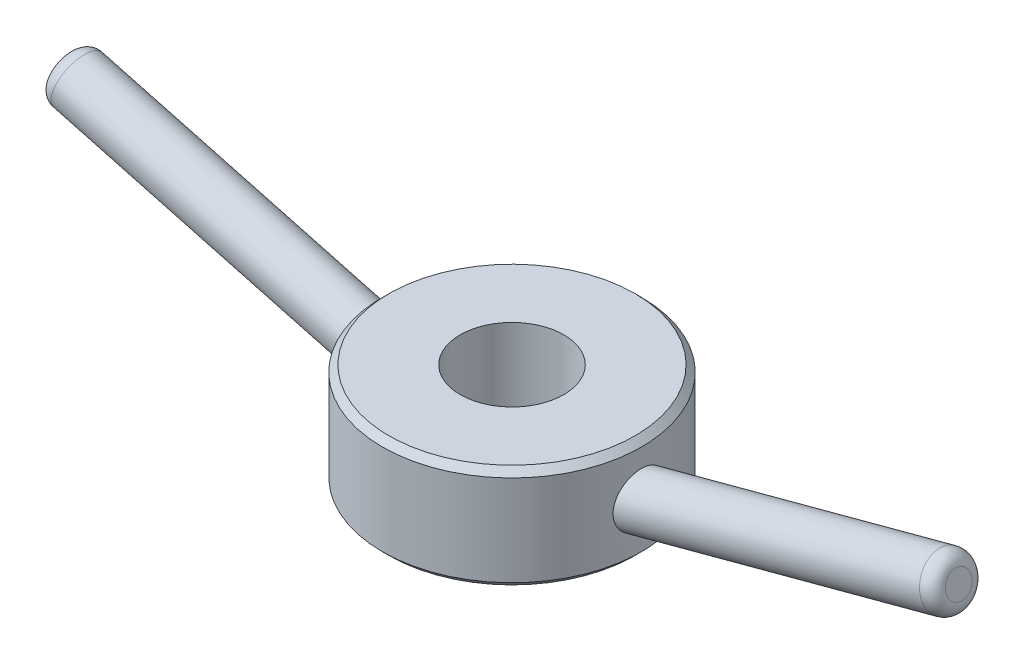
ISO-10303-21;
HEADER;
FILE_DESCRIPTION(('STEP AP214'),'2;1');
FILE_NAME('part.step','',(''),(''),'','','');
FILE_SCHEMA(('AUTOMOTIVE_DESIGN { 1 0 10303 214 1 1 1 1 }'));
ENDSEC;
DATA;
#1=APPLICATION_CONTEXT('core data for automotive mechanical design processes');
#2=APPLICATION_PROTOCOL_DEFINITION('international standard','automotive_design',2000,#1);
#3=PRODUCT_CONTEXT('',#1,'mechanical');
#4=PRODUCT('Part','Part','',(#3));
#5=PRODUCT_RELATED_PRODUCT_CATEGORY('part','',(#4));
#6=PRODUCT_DEFINITION_FORMATION('','',#4);
#7=PRODUCT_DEFINITION_CONTEXT('part definition',#1,'design');
#8=PRODUCT_DEFINITION('design','',#6,#7);
#9=PRODUCT_DEFINITION_SHAPE('','',#8);
#10=(LENGTH_UNIT() NAMED_UNIT(*) SI_UNIT(.MILLI.,.METRE.));
#11=(NAMED_UNIT(*) PLANE_ANGLE_UNIT() SI_UNIT($,.RADIAN.));
#12=(NAMED_UNIT(*) SI_UNIT($,.STERADIAN.) SOLID_ANGLE_UNIT());
#13=UNCERTAINTY_MEASURE_WITH_UNIT(LENGTH_MEASURE(1.E-05),#10,'distance_accuracy_value','');
#14=(GEOMETRIC_REPRESENTATION_CONTEXT(3) GLOBAL_UNCERTAINTY_ASSIGNED_CONTEXT((#13)) GLOBAL_UNIT_ASSIGNED_CONTEXT((#10,
#11,#12)) REPRESENTATION_CONTEXT('',''));
#15=CARTESIAN_POINT('',(0.,0.,0.));
#16=DIRECTION('',(0.,0.,1.));
#17=DIRECTION('',(1.,0.,0.));
#18=AXIS2_PLACEMENT_3D('',#15,#16,#17);
#19=CARTESIAN_POINT('',(0.,25.4,0.));
#20=DIRECTION('',(0.,-1.,0.));
#21=DIRECTION('',(0.,0.,-1.));
#22=AXIS2_PLACEMENT_3D('',#19,#20,#21);
#23=CYLINDRICAL_SURFACE('',#22,63.5);
#24=CARTESIAN_POINT('',(0.,22.2250000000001,0.));
#25=DIRECTION('',(0.,1.,0.));
#26=DIRECTION('',(0.,0.,1.));
#27=AXIS2_PLACEMENT_3D('',#24,#25,#26);
#28=CIRCLE('',#27,63.5);
#29=CARTESIAN_POINT('',(0.,22.2250000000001,-63.5));
#30=VERTEX_POINT('',#29);
#31=EDGE_CURVE('E38',#30,#30,#28,.F.);
#32=ORIENTED_EDGE('',*,*,#31,.T.);
#33=EDGE_LOOP('',(#32));
#34=FACE_BOUND('',#33,.T.);
#35=CARTESIAN_POINT('',(0.,-22.225,0.));
#36=DIRECTION('',(0.,1.,0.));
#37=DIRECTION('',(0.,0.,1.));
#38=AXIS2_PLACEMENT_3D('',#35,#36,#37);
#39=CIRCLE('',#38,63.5);
#40=CARTESIAN_POINT('',(0.,-22.225,63.5));
#41=VERTEX_POINT('',#40);
#42=EDGE_CURVE('E42',#41,#41,#39,.T.);
#43=ORIENTED_EDGE('',*,*,#42,.T.);
#44=EDGE_LOOP('',(#43));
#45=FACE_BOUND('',#44,.T.);
#46=CARTESIAN_POINT('',(-63.5,13.1480074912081,0.));
#47=CARTESIAN_POINT('',(-63.5000030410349,13.1480161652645,0.334108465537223));
#48=CARTESIAN_POINT('',(-63.4973580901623,13.1336423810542,0.668136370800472));
#49=CARTESIAN_POINT('',(-63.4868630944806,13.0763453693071,1.33375525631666));
#50=CARTESIAN_POINT('',(-63.4790120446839,13.0334166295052,1.66534575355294));
#51=CARTESIAN_POINT('',(-63.4583227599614,12.9194835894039,2.32376857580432));
#52=CARTESIAN_POINT('',(-63.4454804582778,12.8484563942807,2.65059679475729));
#53=CARTESIAN_POINT('',(-63.4151811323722,12.6791885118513,3.29688509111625));
#54=CARTESIAN_POINT('',(-63.3977243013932,12.5809489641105,3.61634547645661));
#55=CARTESIAN_POINT('',(-63.3587412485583,12.3586963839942,4.24485303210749));
#56=CARTESIAN_POINT('',(-63.337226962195,12.2347588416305,4.55392768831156));
#57=CARTESIAN_POINT('',(-63.290674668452,11.9622471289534,5.16072766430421));
#58=CARTESIAN_POINT('',(-63.2656366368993,11.81367278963,5.45845290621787));
#59=CARTESIAN_POINT('',(-63.2126890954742,11.4933651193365,6.04081315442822));
#60=CARTESIAN_POINT('',(-63.1847801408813,11.3216362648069,6.32545067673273));
#61=CARTESIAN_POINT('',(-63.1267682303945,10.9564585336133,6.88033396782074));
#62=CARTESIAN_POINT('',(-63.0966644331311,10.7630013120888,7.15057414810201));
#63=CARTESIAN_POINT('',(-63.0335115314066,10.3462274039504,7.68785137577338));
#64=CARTESIAN_POINT('',(-63.0003904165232,10.1219241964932,7.9541146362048));
#65=CARTESIAN_POINT('',(-62.9333599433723,9.65295770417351,8.46814222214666));
#66=CARTESIAN_POINT('',(-62.8994502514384,9.40828568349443,8.71589852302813));
#67=CARTESIAN_POINT('',(-62.8316838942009,8.90043777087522,9.19169501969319));
#68=CARTESIAN_POINT('',(-62.7978272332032,8.63726044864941,9.41973368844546));
#69=CARTESIAN_POINT('',(-62.730979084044,8.09418097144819,9.85508886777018));
#70=CARTESIAN_POINT('',(-62.6979876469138,7.81427783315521,10.0624041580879));
#71=CARTESIAN_POINT('',(-62.6308792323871,7.21473015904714,10.4723328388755));
#72=CARTESIAN_POINT('',(-62.5969099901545,6.89373900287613,10.6730038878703));
#73=CARTESIAN_POINT('',(-62.5318596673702,6.23631269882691,11.0477466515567));
#74=CARTESIAN_POINT('',(-62.5007786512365,5.89987720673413,11.2218177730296));
#75=CARTESIAN_POINT('',(-62.4423700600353,5.21368314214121,11.5423995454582));
#76=CARTESIAN_POINT('',(-62.4150435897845,4.86392068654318,11.688902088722));
#77=CARTESIAN_POINT('',(-62.3649441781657,4.15344047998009,11.9533197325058));
#78=CARTESIAN_POINT('',(-62.3421711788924,3.79272286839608,12.0712351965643));
#79=CARTESIAN_POINT('',(-62.3011223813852,3.04923085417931,12.2813701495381));
#80=CARTESIAN_POINT('',(-62.2830425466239,2.66613298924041,12.3724864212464));
#81=CARTESIAN_POINT('',(-62.2531427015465,1.89351868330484,12.5220624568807));
#82=CARTESIAN_POINT('',(-62.2413202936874,1.50400475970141,12.580534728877));
#83=CARTESIAN_POINT('',(-62.2243773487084,0.721224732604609,12.6640708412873));
#84=CARTESIAN_POINT('',(-62.2192572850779,0.327958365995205,12.6891323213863));
#85=CARTESIAN_POINT('',(-62.2159801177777,-0.459300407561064,12.705191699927));
#86=CARTESIAN_POINT('',(-62.2178227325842,-0.853292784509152,12.6961909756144));
#87=CARTESIAN_POINT('',(-62.2283517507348,-1.62727967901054,12.6444810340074));
#88=CARTESIAN_POINT('',(-62.2368344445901,-2.00734397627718,12.6027751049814));
#89=CARTESIAN_POINT('',(-62.2602174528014,-2.76227153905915,12.4867459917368));
#90=CARTESIAN_POINT('',(-62.2751176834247,-3.13713487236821,12.4124232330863));
#91=CARTESIAN_POINT('',(-62.3109386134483,-3.87855706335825,12.2313300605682));
#92=CARTESIAN_POINT('',(-62.3318578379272,-4.24511793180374,12.1245675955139));
#93=CARTESIAN_POINT('',(-62.3791121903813,-4.9670059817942,11.8790561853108));
#94=CARTESIAN_POINT('',(-62.405447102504,-5.32233361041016,11.7403085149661));
#95=CARTESIAN_POINT('',(-62.4613073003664,-6.00152872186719,11.4392883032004));
#96=CARTESIAN_POINT('',(-62.4906099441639,-6.32608271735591,11.278521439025));
#97=CARTESIAN_POINT('',(-62.5525436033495,-6.95990566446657,10.9298047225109));
#98=CARTESIAN_POINT('',(-62.5851745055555,-7.26917513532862,10.741855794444));
#99=CARTESIAN_POINT('',(-62.6528136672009,-7.87006995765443,10.340039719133));
#100=CARTESIAN_POINT('',(-62.6878216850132,-8.16169709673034,10.1261752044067));
#101=CARTESIAN_POINT('',(-62.7591900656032,-8.72516968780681,9.67400769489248));
#102=CARTESIAN_POINT('',(-62.7955504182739,-8.99701528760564,9.43570488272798));
#103=CARTESIAN_POINT('',(-62.867672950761,-9.51266004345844,8.9423888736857));
#104=CARTESIAN_POINT('',(-62.9034285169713,-9.75697607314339,8.68791463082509));
#105=CARTESIAN_POINT('',(-62.9742003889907,-10.2232014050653,8.15911896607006));
#106=CARTESIAN_POINT('',(-63.0092167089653,-10.445111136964,7.8847979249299));
#107=CARTESIAN_POINT('',(-63.0775286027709,-10.8650443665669,7.3182496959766));
#108=CARTESIAN_POINT('',(-63.110824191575,-11.0630680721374,7.02602266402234));
#109=CARTESIAN_POINT('',(-63.1747660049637,-11.4339417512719,6.4257321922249));
#110=CARTESIAN_POINT('',(-63.205412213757,-11.6067915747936,6.11766865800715));
#111=CARTESIAN_POINT('',(-63.2632051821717,-11.9262176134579,5.48788233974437));
#112=CARTESIAN_POINT('',(-63.2903518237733,-12.0727929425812,5.16615909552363));
#113=CARTESIAN_POINT('',(-63.34039469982,-12.3387439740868,4.51134238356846));
#114=CARTESIAN_POINT('',(-63.3632909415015,-12.4581197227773,4.17824893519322));
#115=CARTESIAN_POINT('',(-63.4042042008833,-12.6689371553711,3.50303841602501));
#116=CARTESIAN_POINT('',(-63.4222211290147,-12.7603783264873,3.16092117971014));
#117=CARTESIAN_POINT('',(-63.4528821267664,-12.9147663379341,2.47007995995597));
#118=CARTESIAN_POINT('',(-63.4655261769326,-12.9777130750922,2.12135595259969));
#119=CARTESIAN_POINT('',(-63.485140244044,-13.0749493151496,1.41817758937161));
#120=CARTESIAN_POINT('',(-63.4920845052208,-13.109108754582,1.06370452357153));
#121=CARTESIAN_POINT('',(-63.5000125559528,-13.1480845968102,0.353081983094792));
#122=CARTESIAN_POINT('',(-63.5009963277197,-13.1529009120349,-0.00306749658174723));
#123=CARTESIAN_POINT('',(-63.4969763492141,-13.1331610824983,-0.714522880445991));
#124=CARTESIAN_POINT('',(-63.4919725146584,-13.1086045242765,-1.06982877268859));
#125=CARTESIAN_POINT('',(-63.476114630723,-13.03026711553,-1.7770724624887));
#126=CARTESIAN_POINT('',(-63.4652605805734,-12.9764862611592,-2.12901025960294));
#127=CARTESIAN_POINT('',(-63.4379820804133,-12.839933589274,-2.82750084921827));
#128=CARTESIAN_POINT('',(-63.4215499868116,-12.7571219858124,-3.17404556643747));
#129=CARTESIAN_POINT('',(-63.3835734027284,-12.5630313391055,-3.85878332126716));
#130=CARTESIAN_POINT('',(-63.3620289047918,-12.4517522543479,-4.19697634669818));
#131=CARTESIAN_POINT('',(-63.3144258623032,-12.201418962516,-4.86259360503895));
#132=CARTESIAN_POINT('',(-63.2883673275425,-12.0623648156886,-5.19001786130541));
#133=CARTESIAN_POINT('',(-63.232463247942,-11.7573587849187,-5.83175288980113));
#134=CARTESIAN_POINT('',(-63.2026177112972,-11.5914069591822,-6.1460636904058));
#135=CARTESIAN_POINT('',(-63.1400289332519,-11.2339697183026,-6.75880512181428));
#136=CARTESIAN_POINT('',(-63.1072906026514,-11.0425273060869,-7.05726133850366));
#137=CARTESIAN_POINT('',(-63.0397939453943,-10.6351478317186,-7.63671906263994));
#138=CARTESIAN_POINT('',(-63.0050356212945,-10.4192108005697,-7.91772059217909));
#139=CARTESIAN_POINT('',(-62.9344823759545,-9.96429744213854,-8.46024652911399));
#140=CARTESIAN_POINT('',(-62.8986875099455,-9.72532234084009,-8.72177197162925));
#141=CARTESIAN_POINT('',(-62.8270735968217,-9.22595797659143,-9.22350579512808));
#142=CARTESIAN_POINT('',(-62.7912545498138,-8.9655688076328,-9.46371426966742));
#143=CARTESIAN_POINT('',(-62.7207747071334,-8.42647330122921,-9.92005504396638));
#144=CARTESIAN_POINT('',(-62.686109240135,-8.14785928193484,-10.1362956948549));
#145=CARTESIAN_POINT('',(-62.618730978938,-7.57318818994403,-10.5445412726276));
#146=CARTESIAN_POINT('',(-62.5860181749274,-7.27713120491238,-10.7365463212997));
#147=CARTESIAN_POINT('',(-62.5234550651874,-6.66970709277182,-11.0950753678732));
#148=CARTESIAN_POINT('',(-62.4936046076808,-6.35834077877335,-11.2616007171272));
#149=CARTESIAN_POINT('',(-62.4375799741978,-5.72252568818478,-11.5681850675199));
#150=CARTESIAN_POINT('',(-62.4114058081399,-5.39807687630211,-11.7082439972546));
#151=CARTESIAN_POINT('',(-62.3634025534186,-4.73803913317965,-11.9612975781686));
#152=CARTESIAN_POINT('',(-62.3415786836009,-4.40243737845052,-12.0742597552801));
#153=CARTESIAN_POINT('',(-62.3028751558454,-3.72286132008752,-12.2724058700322));
#154=CARTESIAN_POINT('',(-62.2859954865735,-3.37888703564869,-12.3575898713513));
#155=CARTESIAN_POINT('',(-62.25758543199,-2.6849520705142,-12.4999331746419));
#156=CARTESIAN_POINT('',(-62.2460554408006,-2.33499095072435,-12.5570904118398));
#157=CARTESIAN_POINT('',(-62.2285922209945,-1.6314939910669,-12.6433478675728));
#158=CARTESIAN_POINT('',(-62.2226591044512,-1.27795807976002,-12.6724475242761));
#159=CARTESIAN_POINT('',(-62.2163985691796,-0.56068372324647,-12.7031495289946));
#160=CARTESIAN_POINT('',(-62.2162167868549,-0.196913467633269,-12.7040374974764));
#161=CARTESIAN_POINT('',(-62.2217554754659,0.529492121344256,-12.6768816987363));
#162=CARTESIAN_POINT('',(-62.2274760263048,0.892127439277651,-12.6488375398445));
#163=CARTESIAN_POINT('',(-62.2445903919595,1.61393740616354,-12.5643471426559));
#164=CARTESIAN_POINT('',(-62.2559843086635,1.97311199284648,-12.5079003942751));
#165=CARTESIAN_POINT('',(-62.2840820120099,2.68589902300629,-12.3672253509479));
#166=CARTESIAN_POINT('',(-62.3007878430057,3.03950926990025,-12.2829863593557));
#167=CARTESIAN_POINT('',(-62.3399424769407,3.75580426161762,-12.0827348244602));
#168=CARTESIAN_POINT('',(-62.3626296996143,4.1181023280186,-11.9653840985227));
#169=CARTESIAN_POINT('',(-62.4126236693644,4.83189254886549,-11.7018114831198));
#170=CARTESIAN_POINT('',(-62.439932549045,5.18337962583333,-11.5555762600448));
#171=CARTESIAN_POINT('',(-62.4983694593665,5.87310839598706,-11.2352265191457));
#172=CARTESIAN_POINT('',(-62.5294977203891,6.21134928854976,-11.0611103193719));
#173=CARTESIAN_POINT('',(-62.5946884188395,6.87230543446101,-10.6860284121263));
#174=CARTESIAN_POINT('',(-62.6287508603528,7.19502066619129,-10.48506266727));
#175=CARTESIAN_POINT('',(-62.6999971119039,7.83290834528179,-10.0503940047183));
#176=CARTESIAN_POINT('',(-62.7372464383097,8.1474931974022,-9.81583830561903));
#177=CARTESIAN_POINT('',(-62.8127243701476,8.75510477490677,-9.32064073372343));
#178=CARTESIAN_POINT('',(-62.8509526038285,9.04813952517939,-9.06000865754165));
#179=CARTESIAN_POINT('',(-62.9272525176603,9.6103538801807,-8.51392421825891));
#180=CARTESIAN_POINT('',(-62.9653241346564,9.87952461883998,-8.22846270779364));
#181=CARTESIAN_POINT('',(-63.0401017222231,10.3912957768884,-7.63447064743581));
#182=CARTESIAN_POINT('',(-63.0768077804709,10.6338979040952,-7.32594158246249));
#183=CARTESIAN_POINT('',(-63.1464713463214,11.0822907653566,-6.69846301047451));
#184=CARTESIAN_POINT('',(-63.1795133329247,11.2890439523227,-6.38021115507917));
#185=CARTESIAN_POINT('',(-63.242155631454,11.6730024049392,-5.72605235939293));
#186=CARTESIAN_POINT('',(-63.271756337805,11.8502110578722,-5.39014744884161));
#187=CARTESIAN_POINT('',(-63.3264935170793,12.1726684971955,-4.70357010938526));
#188=CARTESIAN_POINT('',(-63.3516366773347,12.3179652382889,-4.35292079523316));
#189=CARTESIAN_POINT('',(-63.3966332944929,12.5749174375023,-3.63932914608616));
#190=CARTESIAN_POINT('',(-63.4164886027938,12.6865846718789,-3.276391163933));
#191=CARTESIAN_POINT('',(-63.4550895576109,12.9019970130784,-2.43446390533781));
#192=CARTESIAN_POINT('',(-63.4718441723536,12.9940569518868,-1.95233833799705));
#193=CARTESIAN_POINT('',(-63.4942965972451,13.1170526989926,-0.980083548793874));
#194=CARTESIAN_POINT('',(-63.4999955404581,13.1479947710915,-0.489955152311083));
#195=CARTESIAN_POINT('',(-63.5,13.1480074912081,0.));
#196=B_SPLINE_CURVE_WITH_KNOTS('',3,(#46,#47,#48,#49,#50,#51,#52,#53,#54,#55,#56,#57,#58,#59,
#60,#61,#62,#63,#64,#65,#66,#67,#68,#69,#70,#71,#72,#73,#74,#75,#76,#77,#78,#79,#80,#81,#82,#83,
#84,#85,#86,#87,#88,#89,#90,#91,#92,#93,#94,#95,#96,#97,#98,#99,#100,#101,#102,#103,#104,#105,
#106,#107,#108,#109,#110,#111,#112,#113,#114,#115,#116,#117,#118,#119,#120,#121,#122,#123,#124,
#125,#126,#127,#128,#129,#130,#131,#132,#133,#134,#135,#136,#137,#138,#139,#140,#141,#142,#143,
#144,#145,#146,#147,#148,#149,#150,#151,#152,#153,#154,#155,#156,#157,#158,#159,#160,#161,#162,
#163,#164,#165,#166,#167,#168,#169,#170,#171,#172,#173,#174,#175,#176,#177,#178,#179,#180,#181,
#182,#183,#184,#185,#186,#187,#188,#189,#190,#191,#192,#193,#194,#195),.UNSPECIFIED.,.T.,.F.,(4,
2,2,2,2,2,2,2,2,2,2,2,2,2,2,2,2,2,2,2,2,2,2,2,2,2,2,2,2,2,2,2,2,2,2,2,2,2,2,2,2,2,2,2,2,2,2,2,2,
2,2,2,2,2,2,2,2,2,2,2,2,2,2,2,2,2,2,2,2,2,2,2,2,2,4),(0.,1.00186844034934,2.0039303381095,
3.0068104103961,4.00964849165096,5.00958136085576,6.00952108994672,7.00926777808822,
8.00939974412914,9.05744886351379,10.1059498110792,11.1545318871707,12.2031756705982,
13.3421241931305,14.4810981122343,15.6204064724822,16.7597003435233,17.9408512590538,
19.121549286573,20.3023307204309,21.4830644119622,22.6289300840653,23.7747808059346,
24.9203509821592,26.0658755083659,27.1546587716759,28.2434050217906,29.332040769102,
30.420668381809,31.4831440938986,32.5455994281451,33.6080455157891,34.6704979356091,
35.7329861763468,36.7954726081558,37.8579785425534,38.9204883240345,39.9877732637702,
41.0550613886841,42.1223645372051,43.189667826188,44.2584395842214,45.3272129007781,
46.3959838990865,47.4647525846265,48.5317405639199,49.5987271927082,50.6656570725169,
51.7325822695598,52.7944684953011,53.8563493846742,54.9181739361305,55.9800013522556,
57.0430950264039,58.1061862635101,59.1693558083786,60.2325466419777,61.3226388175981,
62.4127457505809,63.5028722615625,64.5934188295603,65.7366406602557,66.8803914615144,
68.0242112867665,69.168032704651,70.3490919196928,71.529709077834,72.710763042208,
73.8917410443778,75.0330682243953,76.1742644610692,77.3137338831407,78.4528038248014,
79.9221497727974,81.3913451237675),.UNSPECIFIED.);
#197=CARTESIAN_POINT('',(-63.5,13.1480074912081,0.));
#198=VERTEX_POINT('',#197);
#199=EDGE_CURVE('E58',#198,#198,#196,.T.);
#200=ORIENTED_EDGE('',*,*,#199,.T.);
#201=EDGE_LOOP('',(#200));
#202=FACE_BOUND('',#201,.T.);
#203=CARTESIAN_POINT('',(63.5,-13.1480074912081,0.));
#204=CARTESIAN_POINT('',(63.5000031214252,-13.1480125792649,-0.35584768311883));
#205=CARTESIAN_POINT('',(63.4970035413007,-13.133323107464,-0.711615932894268));
#206=CARTESIAN_POINT('',(63.4850938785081,-13.0746609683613,-1.42073835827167));
#207=CARTESIAN_POINT('',(63.4761827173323,-13.0306829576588,-1.77409208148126));
#208=CARTESIAN_POINT('',(63.4526811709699,-12.9136549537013,-2.47602700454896));
#209=CARTESIAN_POINT('',(63.4380864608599,-12.8405828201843,-2.82460436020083));
#210=CARTESIAN_POINT('',(63.4036220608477,-12.6658168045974,-3.51424248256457));
#211=CARTESIAN_POINT('',(63.3837524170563,-12.5641231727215,-3.85530331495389));
#212=CARTESIAN_POINT('',(63.339293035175,-12.3327679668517,-4.52740217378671));
#213=CARTESIAN_POINT('',(63.3147043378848,-12.2031125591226,-4.85844239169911));
#214=CARTESIAN_POINT('',(63.2614875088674,-11.9166314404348,-5.50821847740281));
#215=CARTESIAN_POINT('',(63.2328593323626,-11.7598054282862,-5.82695420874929));
#216=CARTESIAN_POINT('',(63.1723696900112,-11.4200159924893,-6.44977482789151));
#217=CARTESIAN_POINT('',(63.1405088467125,-11.2370575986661,-6.75386252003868));
#218=CARTESIAN_POINT('',(63.0744443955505,-10.8461701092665,-7.345271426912));
#219=CARTESIAN_POINT('',(63.0402408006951,-10.6382411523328,-7.63259273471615));
#220=CARTESIAN_POINT('',(62.9705406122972,-10.199323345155,-8.18774127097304));
#221=CARTESIAN_POINT('',(62.9350473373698,-9.96839134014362,-8.45561385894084));
#222=CARTESIAN_POINT('',(62.8636913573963,-9.48461235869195,-8.97072662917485));
#223=CARTESIAN_POINT('',(62.8278286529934,-9.23176542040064,-9.21796684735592));
#224=CARTESIAN_POINT('',(62.7567486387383,-8.70591589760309,-9.69007235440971));
#225=CARTESIAN_POINT('',(62.7215313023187,-8.43291414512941,-9.91493856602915));
#226=CARTESIAN_POINT('',(62.6527340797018,-7.86867222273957,-10.3407663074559));
#227=CARTESIAN_POINT('',(62.6191541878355,-7.57743211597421,-10.5417279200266));
#228=CARTESIAN_POINT('',(62.5547101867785,-6.9800723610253,-10.9176215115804));
#229=CARTESIAN_POINT('',(62.5238351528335,-6.67402113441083,-11.0926603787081));
#230=CARTESIAN_POINT('',(62.4654888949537,-6.04810116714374,-11.4166460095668));
#231=CARTESIAN_POINT('',(62.4380176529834,-5.72823249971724,-11.5655929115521));
#232=CARTESIAN_POINT('',(62.3872165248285,-5.07697961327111,-11.83656323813));
#233=CARTESIAN_POINT('',(62.3638865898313,-4.74559553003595,-11.9585869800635));
#234=CARTESIAN_POINT('',(62.3219725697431,-4.07367277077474,-12.1751347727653));
#235=CARTESIAN_POINT('',(62.3033885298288,-3.73313400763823,-12.2696585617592));
#236=CARTESIAN_POINT('',(62.271275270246,-3.04211046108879,-12.4316195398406));
#237=CARTESIAN_POINT('',(62.2577944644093,-2.69156276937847,-12.4987977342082));
#238=CARTESIAN_POINT('',(62.2364398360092,-1.9860360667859,-12.6047005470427));
#239=CARTESIAN_POINT('',(62.2285660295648,-1.63105704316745,-12.643425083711));
#240=CARTESIAN_POINT('',(62.2185668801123,-0.919033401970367,-12.6925396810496));
#241=CARTESIAN_POINT('',(62.2164421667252,-0.561988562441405,-12.702926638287));
#242=CARTESIAN_POINT('',(62.2179250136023,0.151812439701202,-12.6956612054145));
#243=CARTESIAN_POINT('',(62.2215329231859,0.508568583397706,-12.6780071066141));
#244=CARTESIAN_POINT('',(62.2345536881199,1.23279294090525,-12.6139383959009));
#245=CARTESIAN_POINT('',(62.2441779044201,1.60016477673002,-12.5664762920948));
#246=CARTESIAN_POINT('',(62.2690763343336,2.32977631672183,-12.4425124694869));
#247=CARTESIAN_POINT('',(62.2843506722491,2.69201590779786,-12.3660101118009));
#248=CARTESIAN_POINT('',(62.3200732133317,3.40910607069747,-12.184703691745));
#249=CARTESIAN_POINT('',(62.3405218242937,3.76395605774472,-12.0798973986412));
#250=CARTESIAN_POINT('',(62.3860043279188,4.46416968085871,-11.8427628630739));
#251=CARTESIAN_POINT('',(62.4110398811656,4.80952982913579,-11.7104246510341));
#252=CARTESIAN_POINT('',(62.4662990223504,5.50491536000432,-11.4120812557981));
#253=CARTESIAN_POINT('',(62.4967146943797,5.85436134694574,-11.2447593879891));
#254=CARTESIAN_POINT('',(62.5609291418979,6.5381256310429,-10.8818245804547));
#255=CARTESIAN_POINT('',(62.59472951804,6.87243666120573,-10.6861982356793));
#256=CARTESIAN_POINT('',(62.6647249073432,7.52347291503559,-10.2677769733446));
#257=CARTESIAN_POINT('',(62.7009205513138,7.8401934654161,-10.0449748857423));
#258=CARTESIAN_POINT('',(62.774626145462,8.45341320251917,-9.57356688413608));
#259=CARTESIAN_POINT('',(62.8121354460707,8.74992217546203,-9.32497360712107));
#260=CARTESIAN_POINT('',(62.8877433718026,9.32321519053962,-8.80071179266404));
#261=CARTESIAN_POINT('',(62.925844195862,9.59978221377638,-8.52480595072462));
#262=CARTESIAN_POINT('',(63.0010897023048,10.1273581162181,-7.9496384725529));
#263=CARTESIAN_POINT('',(63.0382348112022,10.3783785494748,-7.6503875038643));
#264=CARTESIAN_POINT('',(63.1104030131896,10.8524256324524,-7.03025196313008));
#265=CARTESIAN_POINT('',(63.145426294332,11.0754547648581,-6.70936931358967));
#266=CARTESIAN_POINT('',(63.2121906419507,11.4909910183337,-6.0480850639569));
#267=CARTESIAN_POINT('',(63.2439319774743,11.6835006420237,-5.70768506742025));
#268=CARTESIAN_POINT('',(63.3011428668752,12.0243140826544,-5.03217212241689));
#269=CARTESIAN_POINT('',(63.326883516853,12.1746560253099,-4.69811014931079));
#270=CARTESIAN_POINT('',(63.3737036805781,12.4446192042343,-4.01746234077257));
#271=CARTESIAN_POINT('',(63.3947833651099,12.5642415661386,-3.67087696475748));
#272=CARTESIAN_POINT('',(63.4315698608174,12.7711083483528,-2.96810849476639));
#273=CARTESIAN_POINT('',(63.4472798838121,12.8583721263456,-2.61193127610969));
#274=CARTESIAN_POINT('',(63.4728029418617,12.9993734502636,-1.89279685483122));
#275=CARTESIAN_POINT('',(63.4826164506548,13.0531136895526,-1.52984019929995));
#276=CARTESIAN_POINT('',(63.495405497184,13.1230085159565,-0.832995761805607));
#277=CARTESIAN_POINT('',(63.4989136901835,13.1420925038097,-0.499408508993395));
#278=CARTESIAN_POINT('',(63.5006543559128,13.1515706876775,0.168174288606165));
#279=CARTESIAN_POINT('',(63.4988871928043,13.1419668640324,0.502169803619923));
#280=CARTESIAN_POINT('',(63.4901304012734,13.0941971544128,1.16798303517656));
#281=CARTESIAN_POINT('',(63.4831415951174,13.0560357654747,1.49980108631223));
#282=CARTESIAN_POINT('',(63.4641480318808,12.9516333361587,2.15884024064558));
#283=CARTESIAN_POINT('',(63.4521432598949,12.8853922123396,2.48606133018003));
#284=CARTESIAN_POINT('',(63.4238950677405,12.7280296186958,3.12383981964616));
#285=CARTESIAN_POINT('',(63.4077894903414,12.6377134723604,3.43460270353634));
#286=CARTESIAN_POINT('',(63.3716117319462,12.4323943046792,4.0476045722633));
#287=CARTESIAN_POINT('',(63.3515396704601,12.3173920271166,4.34984381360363));
#288=CARTESIAN_POINT('',(63.3079427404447,12.0638696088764,4.94399906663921));
#289=CARTESIAN_POINT('',(63.2844180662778,11.9253507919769,5.23591565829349));
#290=CARTESIAN_POINT('',(63.2344849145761,11.6260345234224,5.80795995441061));
#291=CARTESIAN_POINT('',(63.2080753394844,11.4652285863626,6.08808311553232));
#292=CARTESIAN_POINT('',(63.1515834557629,11.1139238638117,6.64913912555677));
#293=CARTESIAN_POINT('',(63.1213819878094,10.9223215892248,6.92936899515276));
#294=CARTESIAN_POINT('',(63.0592352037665,10.5176311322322,7.47381972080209));
#295=CARTESIAN_POINT('',(63.0272891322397,10.3045336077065,7.73803353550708));
#296=CARTESIAN_POINT('',(62.9624364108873,9.85858117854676,8.24911935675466));
#297=CARTESIAN_POINT('',(62.929529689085,9.62572479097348,8.4959900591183));
#298=CARTESIAN_POINT('',(62.8635286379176,9.14192819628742,8.97130729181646));
#299=CARTESIAN_POINT('',(62.8304342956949,8.89098673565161,9.19975254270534));
#300=CARTESIAN_POINT('',(62.7619290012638,8.34985900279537,9.65651066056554));
#301=CARTESIAN_POINT('',(62.7265703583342,8.05816232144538,9.88304408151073));
#302=CARTESIAN_POINT('',(62.6574722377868,7.45741095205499,10.3120509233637));
#303=CARTESIAN_POINT('',(62.6237327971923,7.14835586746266,10.5145237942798));
#304=CARTESIAN_POINT('',(62.5587576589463,6.51486286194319,10.8944482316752));
#305=CARTESIAN_POINT('',(62.527522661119,6.19042068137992,11.0718928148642));
#306=CARTESIAN_POINT('',(62.4683976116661,5.52826769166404,11.4007553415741));
#307=CARTESIAN_POINT('',(62.4405079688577,5.19055526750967,11.5521701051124));
#308=CARTESIAN_POINT('',(62.3873486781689,4.48418863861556,11.8359951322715));
#309=CARTESIAN_POINT('',(62.3623225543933,4.11487274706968,11.9668078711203));
#310=CARTESIAN_POINT('',(62.3176672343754,3.36645180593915,12.1972179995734));
#311=CARTESIAN_POINT('',(62.2980361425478,2.98735024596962,12.2968263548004));
#312=CARTESIAN_POINT('',(62.264811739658,2.22179195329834,12.4639678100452));
#313=CARTESIAN_POINT('',(62.2512196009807,1.8353338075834,12.5314946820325));
#314=CARTESIAN_POINT('',(62.2305775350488,1.05791341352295,12.6336038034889));
#315=CARTESIAN_POINT('',(62.2235274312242,0.666951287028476,12.6681869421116));
#316=CARTESIAN_POINT('',(62.2163216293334,-0.112314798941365,12.7035289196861));
#317=CARTESIAN_POINT('',(62.2160918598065,-0.500601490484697,12.7046511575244));
#318=CARTESIAN_POINT('',(62.2224416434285,-1.27579450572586,12.6735162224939));
#319=CARTESIAN_POINT('',(62.2290212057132,-1.66270082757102,12.6412590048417));
#320=CARTESIAN_POINT('',(62.2488711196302,-2.43196561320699,12.5431473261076));
#321=CARTESIAN_POINT('',(62.2621397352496,-2.81432523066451,12.4773015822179));
#322=CARTESIAN_POINT('',(62.2950220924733,-3.57145164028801,12.3120799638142));
#323=CARTESIAN_POINT('',(62.3146355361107,-3.94621878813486,12.2127056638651));
#324=CARTESIAN_POINT('',(62.358511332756,-4.66660537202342,11.9866019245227));
#325=CARTESIAN_POINT('',(62.3824937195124,-5.01274716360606,11.8614801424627));
#326=CARTESIAN_POINT('',(62.4349932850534,-5.69264458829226,11.5819611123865));
#327=CARTESIAN_POINT('',(62.4635103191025,-6.02640061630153,11.4275647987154));
#328=CARTESIAN_POINT('',(62.5242438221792,-6.67886816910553,11.0904571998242));
#329=CARTESIAN_POINT('',(62.5564596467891,-6.99758230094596,10.9077508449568));
#330=CARTESIAN_POINT('',(62.6236351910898,-7.61754583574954,10.5152241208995));
#331=CARTESIAN_POINT('',(62.6585948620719,-7.91879554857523,10.3054042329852));
#332=CARTESIAN_POINT('',(62.7289710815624,-8.49148717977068,9.86780494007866));
#333=CARTESIAN_POINT('',(62.7643306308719,-8.76359772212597,9.64089064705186));
#334=CARTESIAN_POINT('',(62.8356223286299,-9.28744625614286,9.16474192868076));
#335=CARTESIAN_POINT('',(62.8715544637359,-9.5391847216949,8.9155080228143));
#336=CARTESIAN_POINT('',(62.9429781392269,-10.0205829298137,8.39643542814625));
#337=CARTESIAN_POINT('',(62.978469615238,-10.2502394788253,8.12659376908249));
#338=CARTESIAN_POINT('',(63.0480020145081,-10.6858764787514,7.56826043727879));
#339=CARTESIAN_POINT('',(63.0820429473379,-10.8918570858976,7.27976888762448));
#340=CARTESIAN_POINT('',(63.1475448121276,-11.277777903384,6.68773542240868));
#341=CARTESIAN_POINT('',(63.1790181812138,-11.4578473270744,6.38427909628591));
#342=CARTESIAN_POINT('',(63.2387066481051,-11.7920531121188,5.76310123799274));
#343=CARTESIAN_POINT('',(63.2669217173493,-11.9461892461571,5.44537958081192));
#344=CARTESIAN_POINT('',(63.3192946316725,-12.2274547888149,4.79814671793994));
#345=CARTESIAN_POINT('',(63.3434554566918,-12.3546040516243,4.46864438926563));
#346=CARTESIAN_POINT('',(63.387079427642,-12.5812273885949,3.80006336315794));
#347=CARTESIAN_POINT('',(63.4065433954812,-12.6807063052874,3.46098635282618));
#348=CARTESIAN_POINT('',(63.4484063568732,-12.8927845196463,2.60935082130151));
#349=CARTESIAN_POINT('',(63.4676609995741,-12.988402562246,2.09231015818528));
#350=CARTESIAN_POINT('',(63.493455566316,-13.1160105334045,1.05012207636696));
#351=CARTESIAN_POINT('',(63.4999953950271,-13.1479999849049,0.524974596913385));
#352=CARTESIAN_POINT('',(63.5,-13.1480074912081,0.));
#353=B_SPLINE_CURVE_WITH_KNOTS('',3,(#203,#204,#205,#206,#207,#208,#209,#210,#211,#212,#213,
#214,#215,#216,#217,#218,#219,#220,#221,#222,#223,#224,#225,#226,#227,#228,#229,#230,#231,#232,
#233,#234,#235,#236,#237,#238,#239,#240,#241,#242,#243,#244,#245,#246,#247,#248,#249,#250,#251,
#252,#253,#254,#255,#256,#257,#258,#259,#260,#261,#262,#263,#264,#265,#266,#267,#268,#269,#270,
#271,#272,#273,#274,#275,#276,#277,#278,#279,#280,#281,#282,#283,#284,#285,#286,#287,#288,#289,
#290,#291,#292,#293,#294,#295,#296,#297,#298,#299,#300,#301,#302,#303,#304,#305,#306,#307,#308,
#309,#310,#311,#312,#313,#314,#315,#316,#317,#318,#319,#320,#321,#322,#323,#324,#325,#326,#327,
#328,#329,#330,#331,#332,#333,#334,#335,#336,#337,#338,#339,#340,#341,#342,#343,#344,#345,#346,
#347,#348,#349,#350,#351,#352),.UNSPECIFIED.,.T.,.F.,(4,2,2,2,2,2,2,2,2,2,2,2,2,2,2,2,2,2,2,2,2,
2,2,2,2,2,2,2,2,2,2,2,2,2,2,2,2,2,2,2,2,2,2,2,2,2,2,2,2,2,2,2,2,2,2,2,2,2,2,2,2,2,2,2,2,2,2,2,2,
2,2,2,2,2,4),(0.,1.06709042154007,2.13437557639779,3.2024744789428,4.27056404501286,
5.33841831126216,6.40628441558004,7.47394525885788,8.54160017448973,9.60667923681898,
10.6717564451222,11.7367897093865,12.8018192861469,13.8623272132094,14.9228295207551,
15.9833193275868,17.0438192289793,18.1141418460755,19.1844675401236,20.2549104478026,
21.3254185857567,22.4358288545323,23.5462635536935,24.6567857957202,25.7677108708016,
26.9322564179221,28.0973553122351,29.2627622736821,30.4276008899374,31.6036372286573,
32.7791392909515,33.954537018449,35.1298383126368,36.2300719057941,37.3302651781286,
38.4297992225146,39.5292449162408,40.5304490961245,41.531584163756,42.532561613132,
43.5335420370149,44.5045174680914,45.4754636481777,46.4463551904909,47.4176174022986,
48.4389592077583,49.460746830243,50.4826112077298,51.5045464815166,52.6163795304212,
53.7282379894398,54.8404060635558,55.9527099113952,57.1290979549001,58.3050721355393,
59.4812745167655,60.6574451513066,61.8208373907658,62.9842311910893,64.1473232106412,
65.3103606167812,66.4155125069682,67.520629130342,68.625553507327,69.730458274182,
70.7973880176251,71.8642929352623,72.9313519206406,73.998403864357,75.0599351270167,
76.1214756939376,77.1822325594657,78.2428036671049,79.8170479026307,81.3913039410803),.UNSPECIFIED.);
#354=CARTESIAN_POINT('',(63.5,-13.1480074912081,0.));
#355=VERTEX_POINT('',#354);
#356=EDGE_CURVE('E90',#355,#355,#353,.T.);
#357=ORIENTED_EDGE('',*,*,#356,.F.);
#358=EDGE_LOOP('',(#357));
#359=FACE_BOUND('',#358,.T.);
#360=ADVANCED_FACE('F31',(#34,#45,#202,#359),#23,.T.);
#361=CARTESIAN_POINT('',(0.,25.4,0.));
#362=DIRECTION('',(0.,1.,0.));
#363=DIRECTION('',(0.,0.,1.));
#364=AXIS2_PLACEMENT_3D('',#361,#362,#363);
#365=PLANE('',#364);
#366=CARTESIAN_POINT('',(0.,25.4,0.));
#367=DIRECTION('',(0.,1.,0.));
#368=DIRECTION('',(0.,0.,1.));
#369=AXIS2_PLACEMENT_3D('',#366,#367,#368);
#370=CIRCLE('',#369,60.3250000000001);
#371=CARTESIAN_POINT('',(0.,25.4,-60.3250000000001));
#372=VERTEX_POINT('',#371);
#373=EDGE_CURVE('E46',#372,#372,#370,.T.);
#374=ORIENTED_EDGE('',*,*,#373,.T.);
#375=EDGE_LOOP('',(#374));
#376=FACE_BOUND('',#375,.T.);
#377=CARTESIAN_POINT('',(0.,25.4,0.));
#378=DIRECTION('',(0.,1.,0.));
#379=DIRECTION('',(0.,0.,1.));
#380=AXIS2_PLACEMENT_3D('',#377,#378,#379);
#381=CIRCLE('',#380,25.4);
#382=CARTESIAN_POINT('',(0.,25.4,25.4));
#383=VERTEX_POINT('',#382);
#384=EDGE_CURVE('E96',#383,#383,#381,.T.);
#385=ORIENTED_EDGE('',*,*,#384,.F.);
#386=EDGE_LOOP('',(#385));
#387=FACE_BOUND('',#386,.T.);
#388=ADVANCED_FACE('F110',(#376,#387),#365,.T.);
#389=CARTESIAN_POINT('',(0.,-25.4,0.));
#390=DIRECTION('',(0.,1.,0.));
#391=DIRECTION('',(0.,0.,1.));
#392=AXIS2_PLACEMENT_3D('',#389,#390,#391);
#393=PLANE('',#392);
#394=CARTESIAN_POINT('',(0.,-25.4,0.));
#395=DIRECTION('',(0.,1.,0.));
#396=DIRECTION('',(0.,0.,1.));
#397=AXIS2_PLACEMENT_3D('',#394,#395,#396);
#398=CIRCLE('',#397,60.325);
#399=CARTESIAN_POINT('',(0.,-25.4,60.325));
#400=VERTEX_POINT('',#399);
#401=EDGE_CURVE('E10',#400,#400,#398,.F.);
#402=ORIENTED_EDGE('',*,*,#401,.T.);
#403=EDGE_LOOP('',(#402));
#404=FACE_BOUND('',#403,.T.);
#405=CARTESIAN_POINT('',(0.,-25.4,0.));
#406=DIRECTION('',(0.,1.,0.));
#407=DIRECTION('',(0.,0.,1.));
#408=AXIS2_PLACEMENT_3D('',#405,#406,#407);
#409=CIRCLE('',#408,25.4);
#410=CARTESIAN_POINT('',(0.,-25.4,25.4));
#411=VERTEX_POINT('',#410);
#412=EDGE_CURVE('E65',#411,#411,#409,.T.);
#413=ORIENTED_EDGE('',*,*,#412,.T.);
#414=EDGE_LOOP('',(#413));
#415=FACE_BOUND('',#414,.T.);
#416=ADVANCED_FACE('F114',(#404,#415),#393,.F.);
#417=CARTESIAN_POINT('',(0.,25.4,0.));
#418=DIRECTION('',(0.,-1.,0.));
#419=DIRECTION('',(0.,0.,-1.));
#420=AXIS2_PLACEMENT_3D('',#417,#418,#419);
#421=CYLINDRICAL_SURFACE('',#420,25.4);
#422=ORIENTED_EDGE('',*,*,#384,.T.);
#423=EDGE_LOOP('',(#422));
#424=FACE_BOUND('',#423,.T.);
#425=ORIENTED_EDGE('',*,*,#412,.F.);
#426=EDGE_LOOP('',(#425));
#427=FACE_BOUND('',#426,.T.);
#428=ADVANCED_FACE('F86',(#424,#427),#421,.F.);
#429=CARTESIAN_POINT('',(218.930708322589,41.6475327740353,0.));
#430=DIRECTION('',(-0.965925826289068,-0.258819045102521,0.));
#431=DIRECTION('',(0.258819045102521,-0.965925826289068,0.));
#432=AXIS2_PLACEMENT_3D('',#429,#430,#431);
#433=CYLINDRICAL_SURFACE('',#432,12.7);
#434=CARTESIAN_POINT('',(212.797079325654,40.0040318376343,0.));
#435=DIRECTION('',(0.965925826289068,0.258819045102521,0.));
#436=DIRECTION('',(-0.258819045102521,0.965925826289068,0.));
#437=AXIS2_PLACEMENT_3D('',#434,#435,#436);
#438=CIRCLE('',#437,12.7);
#439=CARTESIAN_POINT('',(209.510077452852,52.2712898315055,0.));
#440=VERTEX_POINT('',#439);
#441=EDGE_CURVE('E57',#440,#440,#438,.F.);
#442=ORIENTED_EDGE('',*,*,#441,.T.);
#443=EDGE_LOOP('',(#442));
#444=FACE_BOUND('',#443,.T.);
#445=ORIENTED_EDGE('',*,*,#356,.T.);
#446=EDGE_LOOP('',(#445));
#447=FACE_BOUND('',#446,.T.);
#448=ADVANCED_FACE('F81',(#444,#447),#433,.T.);
#449=CARTESIAN_POINT('',(218.930708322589,41.6475327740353,0.));
#450=DIRECTION('',(0.965925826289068,0.258819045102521,0.));
#451=DIRECTION('',(-0.258819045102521,0.965925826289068,0.));
#452=AXIS2_PLACEMENT_3D('',#449,#450,#451);
#453=PLANE('',#452);
#454=CARTESIAN_POINT('',(218.930708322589,41.6475327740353,0.));
#455=DIRECTION('',(0.965925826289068,0.258819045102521,0.));
#456=DIRECTION('',(-0.258819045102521,0.965925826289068,0.));
#457=AXIS2_PLACEMENT_3D('',#454,#455,#456);
#458=CIRCLE('',#457,6.35);
#459=CARTESIAN_POINT('',(217.287207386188,47.7811617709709,0.));
#460=VERTEX_POINT('',#459);
#461=EDGE_CURVE('E95',#460,#460,#458,.T.);
#462=ORIENTED_EDGE('',*,*,#461,.T.);
#463=EDGE_LOOP('',(#462));
#464=FACE_BOUND('',#463,.T.);
#465=ADVANCED_FACE('F78',(#464),#453,.T.);
#466=CARTESIAN_POINT('',(212.797079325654,40.0040318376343,0.));
#467=DIRECTION('',(0.965925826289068,0.258819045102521,0.));
#468=DIRECTION('',(-0.258819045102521,0.965925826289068,0.));
#469=AXIS2_PLACEMENT_3D('',#466,#467,#468);
#470=DEGENERATE_TOROIDAL_SURFACE('',#469,6.35,6.35,.T.);
#471=ORIENTED_EDGE('',*,*,#441,.F.);
#472=EDGE_LOOP('',(#471));
#473=FACE_BOUND('',#472,.T.);
#474=ORIENTED_EDGE('',*,*,#461,.F.);
#475=EDGE_LOOP('',(#474));
#476=FACE_BOUND('',#475,.T.);
#477=ADVANCED_FACE('F76',(#473,#476),#470,.T.);
#478=CARTESIAN_POINT('',(-218.930708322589,41.6475327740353,0.));
#479=DIRECTION('',(0.965925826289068,-0.258819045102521,0.));
#480=DIRECTION('',(0.258819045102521,0.965925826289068,0.));
#481=AXIS2_PLACEMENT_3D('',#478,#479,#480);
#482=CYLINDRICAL_SURFACE('',#481,12.7);
#483=CARTESIAN_POINT('',(-212.797079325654,40.0040318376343,0.));
#484=DIRECTION('',(-0.965925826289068,0.258819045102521,0.));
#485=DIRECTION('',(-0.258819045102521,-0.965925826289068,0.));
#486=AXIS2_PLACEMENT_3D('',#483,#484,#485);
#487=CIRCLE('',#486,12.7);
#488=CARTESIAN_POINT('',(-216.084081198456,27.7367738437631,0.));
#489=VERTEX_POINT('',#488);
#490=EDGE_CURVE('E54',#489,#489,#487,.F.);
#491=ORIENTED_EDGE('',*,*,#490,.T.);
#492=EDGE_LOOP('',(#491));
#493=FACE_BOUND('',#492,.T.);
#494=ORIENTED_EDGE('',*,*,#199,.F.);
#495=EDGE_LOOP('',(#494));
#496=FACE_BOUND('',#495,.T.);
#497=ADVANCED_FACE('F70',(#493,#496),#482,.T.);
#498=CARTESIAN_POINT('',(-218.930708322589,41.6475327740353,0.));
#499=DIRECTION('',(-0.965925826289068,0.258819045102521,0.));
#500=DIRECTION('',(0.258819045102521,0.965925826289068,0.));
#501=AXIS2_PLACEMENT_3D('',#498,#499,#500);
#502=PLANE('',#501);
#503=CARTESIAN_POINT('',(-218.930708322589,41.6475327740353,0.));
#504=DIRECTION('',(-0.965925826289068,0.258819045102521,0.));
#505=DIRECTION('',(-0.258819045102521,-0.965925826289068,0.));
#506=AXIS2_PLACEMENT_3D('',#503,#504,#505);
#507=CIRCLE('',#506,6.35);
#508=CARTESIAN_POINT('',(-220.57420925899,35.5139037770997,0.));
#509=VERTEX_POINT('',#508);
#510=EDGE_CURVE('E51',#509,#509,#507,.T.);
#511=ORIENTED_EDGE('',*,*,#510,.T.);
#512=EDGE_LOOP('',(#511));
#513=FACE_BOUND('',#512,.T.);
#514=ADVANCED_FACE('F75',(#513),#502,.T.);
#515=CARTESIAN_POINT('',(-212.797079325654,40.0040318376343,0.));
#516=DIRECTION('',(-0.965925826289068,0.258819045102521,0.));
#517=DIRECTION('',(-0.258819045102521,-0.965925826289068,0.));
#518=AXIS2_PLACEMENT_3D('',#515,#516,#517);
#519=DEGENERATE_TOROIDAL_SURFACE('',#518,6.35,6.35,.T.);
#520=ORIENTED_EDGE('',*,*,#510,.F.);
#521=EDGE_LOOP('',(#520));
#522=FACE_BOUND('',#521,.T.);
#523=ORIENTED_EDGE('',*,*,#490,.F.);
#524=EDGE_LOOP('',(#523));
#525=FACE_BOUND('',#524,.T.);
#526=ADVANCED_FACE('F130',(#522,#525),#519,.T.);
#527=CARTESIAN_POINT('',(0.,25.4,0.));
#528=DIRECTION('',(0.,-1.,0.));
#529=DIRECTION('',(0.,0.,-1.));
#530=AXIS2_PLACEMENT_3D('',#527,#528,#529);
#531=CONICAL_SURFACE('',#530,60.3250000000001,0.785398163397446);
#532=CARTESIAN_POINT('',(0.,22.2250000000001,-63.5));
#533=CARTESIAN_POINT('',(0.,22.2580729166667,-63.4669270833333));
#534=CARTESIAN_POINT('',(0.,22.2911458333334,-63.4338541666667));
#535=CARTESIAN_POINT('',(0.,22.3572916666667,-63.3677083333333));
#536=CARTESIAN_POINT('',(0.,22.3903645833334,-63.3346354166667));
#537=CARTESIAN_POINT('',(0.,22.4565104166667,-63.2684895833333));
#538=CARTESIAN_POINT('',(0.,22.4895833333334,-63.2354166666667));
#539=CARTESIAN_POINT('',(0.,22.5557291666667,-63.1692708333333));
#540=CARTESIAN_POINT('',(0.,22.5888020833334,-63.1361979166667));
#541=CARTESIAN_POINT('',(0.,22.6549479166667,-63.0700520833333));
#542=CARTESIAN_POINT('',(0.,22.6880208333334,-63.0369791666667));
#543=CARTESIAN_POINT('',(0.,22.7541666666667,-62.9708333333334));
#544=CARTESIAN_POINT('',(0.,22.7872395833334,-62.9377604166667));
#545=CARTESIAN_POINT('',(0.,22.8533854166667,-62.8716145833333));
#546=CARTESIAN_POINT('',(0.,22.8864583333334,-62.8385416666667));
#547=CARTESIAN_POINT('',(0.,22.9526041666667,-62.7723958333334));
#548=CARTESIAN_POINT('',(0.,22.9856770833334,-62.7393229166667));
#549=CARTESIAN_POINT('',(0.,23.0518229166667,-62.6731770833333));
#550=CARTESIAN_POINT('',(0.,23.0848958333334,-62.6401041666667));
#551=CARTESIAN_POINT('',(0.,23.1510416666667,-62.5739583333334));
#552=CARTESIAN_POINT('',(0.,23.1841145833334,-62.5408854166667));
#553=CARTESIAN_POINT('',(0.,23.2502604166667,-62.4747395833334));
#554=CARTESIAN_POINT('',(0.,23.2833333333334,-62.4416666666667));
#555=CARTESIAN_POINT('',(0.,23.3494791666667,-62.3755208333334));
#556=CARTESIAN_POINT('',(0.,23.3825520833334,-62.3424479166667));
#557=CARTESIAN_POINT('',(0.,23.4486979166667,-62.2763020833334));
#558=CARTESIAN_POINT('',(0.,23.4817708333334,-62.2432291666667));
#559=CARTESIAN_POINT('',(0.,23.5479166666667,-62.1770833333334));
#560=CARTESIAN_POINT('',(0.,23.5809895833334,-62.1440104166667));
#561=CARTESIAN_POINT('',(0.,23.6471354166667,-62.0778645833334));
#562=CARTESIAN_POINT('',(0.,23.6802083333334,-62.0447916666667));
#563=CARTESIAN_POINT('',(0.,23.7463541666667,-61.9786458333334));
#564=CARTESIAN_POINT('',(0.,23.7794270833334,-61.9455729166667));
#565=CARTESIAN_POINT('',(0.,23.8455729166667,-61.8794270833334));
#566=CARTESIAN_POINT('',(0.,23.8786458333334,-61.8463541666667));
#567=CARTESIAN_POINT('',(0.,23.9447916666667,-61.7802083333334));
#568=CARTESIAN_POINT('',(0.,23.9778645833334,-61.7471354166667));
#569=CARTESIAN_POINT('',(0.,24.0440104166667,-61.6809895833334));
#570=CARTESIAN_POINT('',(0.,24.0770833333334,-61.6479166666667));
#571=CARTESIAN_POINT('',(0.,24.1432291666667,-61.5817708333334));
#572=CARTESIAN_POINT('',(0.,24.1763020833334,-61.5486979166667));
#573=CARTESIAN_POINT('',(0.,24.2424479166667,-61.4825520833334));
#574=CARTESIAN_POINT('',(0.,24.2755208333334,-61.4494791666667));
#575=CARTESIAN_POINT('',(0.,24.3416666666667,-61.3833333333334));
#576=CARTESIAN_POINT('',(0.,24.3747395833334,-61.3502604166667));
#577=CARTESIAN_POINT('',(0.,24.4408854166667,-61.2841145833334));
#578=CARTESIAN_POINT('',(0.,24.4739583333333,-61.2510416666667));
#579=CARTESIAN_POINT('',(0.,24.5401041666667,-61.1848958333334));
#580=CARTESIAN_POINT('',(0.,24.5731770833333,-61.1518229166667));
#581=CARTESIAN_POINT('',(0.,24.6393229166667,-61.0856770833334));
#582=CARTESIAN_POINT('',(0.,24.6723958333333,-61.0526041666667));
#583=CARTESIAN_POINT('',(0.,24.7385416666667,-60.9864583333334));
#584=CARTESIAN_POINT('',(0.,24.7716145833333,-60.9533854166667));
#585=CARTESIAN_POINT('',(0.,24.8377604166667,-60.8872395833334));
#586=CARTESIAN_POINT('',(0.,24.8708333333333,-60.8541666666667));
#587=CARTESIAN_POINT('',(0.,24.9369791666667,-60.7880208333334));
#588=CARTESIAN_POINT('',(0.,24.9700520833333,-60.7549479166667));
#589=CARTESIAN_POINT('',(0.,25.0361979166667,-60.6888020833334));
#590=CARTESIAN_POINT('',(0.,25.0692708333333,-60.6557291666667));
#591=CARTESIAN_POINT('',(0.,25.1354166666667,-60.5895833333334));
#592=CARTESIAN_POINT('',(0.,25.1684895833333,-60.5565104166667));
#593=CARTESIAN_POINT('',(0.,25.2346354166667,-60.4903645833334));
#594=CARTESIAN_POINT('',(0.,25.2677083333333,-60.4572916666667));
#595=CARTESIAN_POINT('',(0.,25.3338541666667,-60.3911458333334));
#596=CARTESIAN_POINT('',(0.,25.3669270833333,-60.3580729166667));
#597=CARTESIAN_POINT('',(0.,25.4,-60.3250000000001));
#598=B_SPLINE_CURVE_WITH_KNOTS('',3,(#532,#533,#534,#535,#536,#537,#538,#539,#540,#541,#542,
#543,#544,#545,#546,#547,#548,#549,#550,#551,#552,#553,#554,#555,#556,#557,#558,#559,#560,#561,
#562,#563,#564,#565,#566,#567,#568,#569,#570,#571,#572,#573,#574,#575,#576,#577,#578,#579,#580,
#581,#582,#583,#584,#585,#586,#587,#588,#589,#590,#591,#592,#593,#594,#595,#596,#597),
.UNSPECIFIED.,.F.,.F.,(4,2,2,2,2,2,2,2,2,2,2,2,2,2,2,2,2,2,2,2,2,2,2,2,2,2,2,2,2,2,2,2,4),(0.,
0.1403165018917,0.280633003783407,0.420949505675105,0.561266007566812,0.701582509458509,
0.841899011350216,0.982215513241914,1.12253201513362,1.26284851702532,1.40316501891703,
1.54348152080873,1.68379802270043,1.82411452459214,1.96443102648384,2.10474752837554,
2.24506403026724,2.38538053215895,2.52569703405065,2.66601353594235,2.80633003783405,
2.94664653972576,3.08696304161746,3.22727954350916,3.36759604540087,3.50791254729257,
3.64822904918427,3.78854555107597,3.92886205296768,4.06917855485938,4.20949505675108,
4.34981155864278,4.49012806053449),.UNSPECIFIED.);
#599=EDGE_CURVE('BSEAM125',#30,#372,#598,.T.);
#600=ORIENTED_EDGE('',*,*,#31,.F.);
#601=ORIENTED_EDGE('',*,*,#373,.F.);
#602=ORIENTED_EDGE('',*,*,#599,.T.);
#603=ORIENTED_EDGE('',*,*,#599,.F.);
#604=EDGE_LOOP('',(#600,#602,#601,#603));
#605=FACE_BOUND('',#604,.T.);
#606=ADVANCED_FACE('F125',(#605),#531,.T.);
#607=CARTESIAN_POINT('',(0.,-22.225,0.));
#608=DIRECTION('',(0.,1.,0.));
#609=DIRECTION('',(0.,0.,1.));
#610=AXIS2_PLACEMENT_3D('',#607,#608,#609);
#611=CONICAL_SURFACE('',#610,63.5,0.785398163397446);
#612=ORIENTED_EDGE('',*,*,#401,.F.);
#613=EDGE_LOOP('',(#612));
#614=FACE_BOUND('',#613,.T.);
#615=ORIENTED_EDGE('',*,*,#42,.F.);
#616=EDGE_LOOP('',(#615));
#617=FACE_BOUND('',#616,.T.);
#618=ADVANCED_FACE('F33',(#614,#617),#611,.T.);
#619=CLOSED_SHELL('',(#360,#388,#416,#428,#448,#465,#477,#497,#514,#526,#606,#618));
#620=MANIFOLD_SOLID_BREP('B2',#619);
#621=ADVANCED_BREP_SHAPE_REPRESENTATION('',(#18,#620),#14);
#622=SHAPE_DEFINITION_REPRESENTATION(#9,#621);
ENDSEC;
END-ISO-10303-21;
